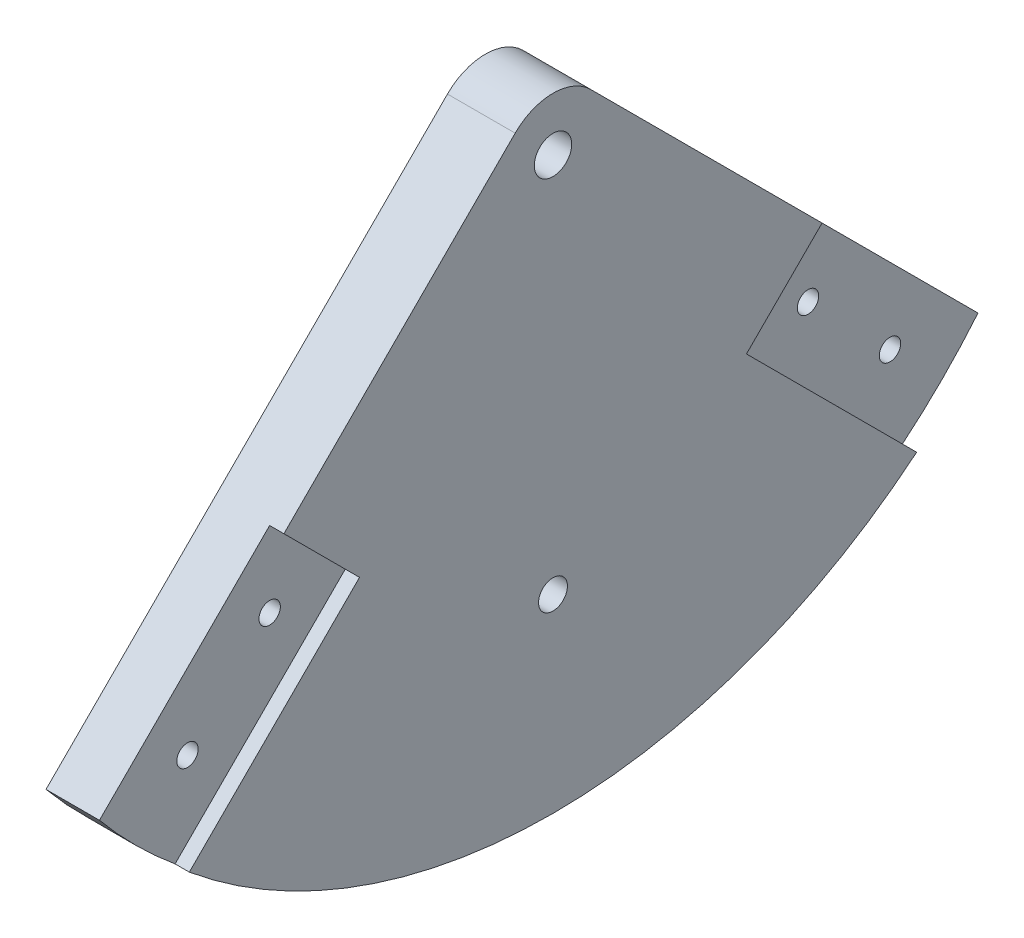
ISO-10303-21;
HEADER;
FILE_DESCRIPTION(('STEP AP214'),'2;1');
FILE_NAME('part.step','',(''),(''),'','','');
FILE_SCHEMA(('AUTOMOTIVE_DESIGN { 1 0 10303 214 1 1 1 1 }'));
ENDSEC;
DATA;
#1=APPLICATION_CONTEXT('core data for automotive mechanical design processes');
#2=APPLICATION_PROTOCOL_DEFINITION('international standard','automotive_design',2000,#1);
#3=PRODUCT_CONTEXT('',#1,'mechanical');
#4=PRODUCT('Part','Part','',(#3));
#5=PRODUCT_RELATED_PRODUCT_CATEGORY('part','',(#4));
#6=PRODUCT_DEFINITION_FORMATION('','',#4);
#7=PRODUCT_DEFINITION_CONTEXT('part definition',#1,'design');
#8=PRODUCT_DEFINITION('design','',#6,#7);
#9=PRODUCT_DEFINITION_SHAPE('','',#8);
#10=(LENGTH_UNIT() NAMED_UNIT(*) SI_UNIT(.MILLI.,.METRE.));
#11=(NAMED_UNIT(*) PLANE_ANGLE_UNIT() SI_UNIT($,.RADIAN.));
#12=(NAMED_UNIT(*) SI_UNIT($,.STERADIAN.) SOLID_ANGLE_UNIT());
#13=UNCERTAINTY_MEASURE_WITH_UNIT(LENGTH_MEASURE(1.E-05),#10,'distance_accuracy_value','');
#14=(GEOMETRIC_REPRESENTATION_CONTEXT(3) GLOBAL_UNCERTAINTY_ASSIGNED_CONTEXT((#13)) GLOBAL_UNIT_ASSIGNED_CONTEXT((#10,
#11,#12)) REPRESENTATION_CONTEXT('',''));
#15=CARTESIAN_POINT('',(0.,0.,0.));
#16=DIRECTION('',(0.,0.,1.));
#17=DIRECTION('',(1.,0.,0.));
#18=AXIS2_PLACEMENT_3D('',#15,#16,#17);
#19=CARTESIAN_POINT('',(-19.,-75.4954988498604,-75.5500035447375));
#20=DIRECTION('',(1.,0.,0.));
#21=DIRECTION('',(0.,0.,-1.));
#22=AXIS2_PLACEMENT_3D('',#19,#20,#21);
#23=CYLINDRICAL_SURFACE('',#22,2.99999999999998);
#24=CARTESIAN_POINT('',(-19.,-75.4954988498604,-75.5500035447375));
#25=DIRECTION('',(1.,0.,0.));
#26=DIRECTION('',(0.,0.,-1.));
#27=AXIS2_PLACEMENT_3D('',#24,#25,#26);
#28=CIRCLE('',#27,2.99999999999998);
#29=CARTESIAN_POINT('',(-19.,-75.4954988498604,-78.5500035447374));
#30=VERTEX_POINT('',#29);
#31=EDGE_CURVE('E174',#30,#30,#28,.T.);
#32=ORIENTED_EDGE('',*,*,#31,.F.);
#33=EDGE_LOOP('',(#32));
#34=FACE_BOUND('',#33,.T.);
#35=CARTESIAN_POINT('',(-4.,-75.4954988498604,-75.5500035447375));
#36=DIRECTION('',(1.,0.,0.));
#37=DIRECTION('',(0.,0.,-1.));
#38=AXIS2_PLACEMENT_3D('',#35,#36,#37);
#39=CIRCLE('',#38,2.99999999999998);
#40=CARTESIAN_POINT('',(-4.,-75.4954988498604,-78.5500035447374));
#41=VERTEX_POINT('',#40);
#42=EDGE_CURVE('E225',#41,#41,#39,.F.);
#43=ORIENTED_EDGE('',*,*,#42,.F.);
#44=EDGE_LOOP('',(#43));
#45=FACE_BOUND('',#44,.T.);
#46=ADVANCED_FACE('F32',(#34,#45),#23,.F.);
#47=CARTESIAN_POINT('',(-19.,-98.5517278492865,-98.5503947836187));
#48=DIRECTION('',(1.,0.,0.));
#49=DIRECTION('',(0.,0.,-1.));
#50=AXIS2_PLACEMENT_3D('',#47,#48,#49);
#51=CYLINDRICAL_SURFACE('',#50,3.00000000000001);
#52=CARTESIAN_POINT('',(-19.,-98.5517278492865,-98.5503947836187));
#53=DIRECTION('',(1.,0.,0.));
#54=DIRECTION('',(0.,0.,-1.));
#55=AXIS2_PLACEMENT_3D('',#52,#53,#54);
#56=CIRCLE('',#55,3.00000000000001);
#57=CARTESIAN_POINT('',(-19.,-98.5517278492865,-101.550394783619));
#58=VERTEX_POINT('',#57);
#59=EDGE_CURVE('E153',#58,#58,#56,.T.);
#60=ORIENTED_EDGE('',*,*,#59,.F.);
#61=EDGE_LOOP('',(#60));
#62=FACE_BOUND('',#61,.T.);
#63=CARTESIAN_POINT('',(-4.,-98.5517278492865,-98.5503947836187));
#64=DIRECTION('',(1.,0.,0.));
#65=DIRECTION('',(0.,0.,-1.));
#66=AXIS2_PLACEMENT_3D('',#63,#64,#65);
#67=CIRCLE('',#66,3.00000000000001);
#68=CARTESIAN_POINT('',(-4.,-98.5517278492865,-101.550394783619));
#69=VERTEX_POINT('',#68);
#70=EDGE_CURVE('E36',#69,#69,#67,.F.);
#71=ORIENTED_EDGE('',*,*,#70,.F.);
#72=EDGE_LOOP('',(#71));
#73=FACE_BOUND('',#72,.T.);
#74=ADVANCED_FACE('F262',(#62,#73),#51,.F.);
#75=CARTESIAN_POINT('',(-19.,-75.4954988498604,75.4969964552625));
#76=DIRECTION('',(1.,0.,0.));
#77=DIRECTION('',(0.,0.,-1.));
#78=AXIS2_PLACEMENT_3D('',#75,#76,#77);
#79=CYLINDRICAL_SURFACE('',#78,2.99999999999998);
#80=CARTESIAN_POINT('',(-19.,-75.4954988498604,75.4969964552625));
#81=DIRECTION('',(1.,0.,0.));
#82=DIRECTION('',(0.,0.,-1.));
#83=AXIS2_PLACEMENT_3D('',#80,#81,#82);
#84=CIRCLE('',#83,2.99999999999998);
#85=CARTESIAN_POINT('',(-19.,-75.4954988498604,72.4969964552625));
#86=VERTEX_POINT('',#85);
#87=EDGE_CURVE('E177',#86,#86,#84,.T.);
#88=ORIENTED_EDGE('',*,*,#87,.F.);
#89=EDGE_LOOP('',(#88));
#90=FACE_BOUND('',#89,.T.);
#91=CARTESIAN_POINT('',(-4.,-75.4954988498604,75.4969964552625));
#92=DIRECTION('',(1.,0.,0.));
#93=DIRECTION('',(0.,0.,-1.));
#94=AXIS2_PLACEMENT_3D('',#91,#92,#93);
#95=CIRCLE('',#94,2.99999999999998);
#96=CARTESIAN_POINT('',(-4.,-75.4954988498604,72.4969964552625));
#97=VERTEX_POINT('',#96);
#98=EDGE_CURVE('E148',#97,#97,#95,.F.);
#99=ORIENTED_EDGE('',*,*,#98,.F.);
#100=EDGE_LOOP('',(#99));
#101=FACE_BOUND('',#100,.T.);
#102=ADVANCED_FACE('F268',(#90,#101),#79,.F.);
#103=CARTESIAN_POINT('',(-19.,-98.5517278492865,98.5530609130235));
#104=DIRECTION('',(1.,0.,0.));
#105=DIRECTION('',(0.,0.,-1.));
#106=AXIS2_PLACEMENT_3D('',#103,#104,#105);
#107=CYLINDRICAL_SURFACE('',#106,3.00000000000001);
#108=CARTESIAN_POINT('',(-19.,-98.5517278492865,98.5530609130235));
#109=DIRECTION('',(1.,0.,0.));
#110=DIRECTION('',(0.,0.,-1.));
#111=AXIS2_PLACEMENT_3D('',#108,#109,#110);
#112=CIRCLE('',#111,3.00000000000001);
#113=CARTESIAN_POINT('',(-19.,-98.5517278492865,95.5530609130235));
#114=VERTEX_POINT('',#113);
#115=EDGE_CURVE('E171',#114,#114,#112,.T.);
#116=ORIENTED_EDGE('',*,*,#115,.F.);
#117=EDGE_LOOP('',(#116));
#118=FACE_BOUND('',#117,.T.);
#119=CARTESIAN_POINT('',(-4.,-98.5517278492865,98.5530609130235));
#120=DIRECTION('',(1.,0.,0.));
#121=DIRECTION('',(0.,0.,-1.));
#122=AXIS2_PLACEMENT_3D('',#119,#120,#121);
#123=CIRCLE('',#122,3.00000000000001);
#124=CARTESIAN_POINT('',(-4.,-98.5517278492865,95.5530609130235));
#125=VERTEX_POINT('',#124);
#126=EDGE_CURVE('E146',#125,#125,#123,.F.);
#127=ORIENTED_EDGE('',*,*,#126,.F.);
#128=EDGE_LOOP('',(#127));
#129=FACE_BOUND('',#128,.T.);
#130=ADVANCED_FACE('F275',(#118,#129),#107,.F.);
#131=CARTESIAN_POINT('',(-19.,-0.00135693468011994,0.0011233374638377));
#132=DIRECTION('',(1.,0.,0.));
#133=DIRECTION('',(0.,0.,-1.));
#134=AXIS2_PLACEMENT_3D('',#131,#132,#133);
#135=CYLINDRICAL_SURFACE('',#134,15.0017864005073);
#136=CARTESIAN_POINT('',(0.,-0.00135693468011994,0.0011233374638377));
#137=DIRECTION('',(1.,0.,0.));
#138=DIRECTION('',(0.,0.,1.));
#139=AXIS2_PLACEMENT_3D('',#136,#137,#138);
#140=CIRCLE('',#139,15.0017864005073);
#141=CARTESIAN_POINT('',(0.,10.6066361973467,-10.6066133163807));
#142=VERTEX_POINT('',#141);
#143=CARTESIAN_POINT('',(0.,10.6065368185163,10.6089593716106));
#144=VERTEX_POINT('',#143);
#145=EDGE_CURVE('E190',#142,#144,#140,.T.);
#146=ORIENTED_EDGE('',*,*,#145,.F.);
#147=DIRECTION('',(1.,0.,0.));
#148=VECTOR('',#147,1.);
#149=CARTESIAN_POINT('',(-19.,10.6066361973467,-10.6066133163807));
#150=LINE('',#149,#148);
#151=CARTESIAN_POINT('',(-19.,10.6066361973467,-10.6066133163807));
#152=VERTEX_POINT('',#151);
#153=EDGE_CURVE('E11',#152,#142,#150,.T.);
#154=ORIENTED_EDGE('',*,*,#153,.F.);
#155=CARTESIAN_POINT('',(-19.,-0.00135693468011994,0.0011233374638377));
#156=DIRECTION('',(1.,0.,0.));
#157=DIRECTION('',(0.,0.,1.));
#158=AXIS2_PLACEMENT_3D('',#155,#156,#157);
#159=CIRCLE('',#158,15.0017864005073);
#160=CARTESIAN_POINT('',(-19.,10.6065368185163,10.6089593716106));
#161=VERTEX_POINT('',#160);
#162=EDGE_CURVE('E193',#152,#161,#159,.T.);
#163=ORIENTED_EDGE('',*,*,#162,.T.);
#164=DIRECTION('',(1.,0.,0.));
#165=VECTOR('',#164,1.);
#166=CARTESIAN_POINT('',(-19.,10.6065368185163,10.6089593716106));
#167=LINE('',#166,#165);
#168=EDGE_CURVE('E141',#161,#144,#167,.T.);
#169=ORIENTED_EDGE('',*,*,#168,.T.);
#170=EDGE_LOOP('',(#146,#154,#163,#169));
#171=FACE_BOUND('',#170,.T.);
#172=ADVANCED_FACE('F34',(#171),#135,.T.);
#173=CARTESIAN_POINT('',(-19.,-102.032204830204,-123.24817777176));
#174=DIRECTION('',(0.,0.70711532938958,-0.707098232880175));
#175=DIRECTION('',(0.,0.707098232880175,0.70711532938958));
#176=AXIS2_PLACEMENT_3D('',#173,#174,#175);
#177=PLANE('',#176);
#178=DIRECTION('',(1.,0.,0.));
#179=VECTOR('',#178,1.);
#180=CARTESIAN_POINT('',(-4.,-54.2822909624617,-75.4971093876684));
#181=LINE('',#180,#179);
#182=CARTESIAN_POINT('',(-4.,-54.2822909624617,-75.4971093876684));
#183=VERTEX_POINT('',#182);
#184=CARTESIAN_POINT('',(0.,-54.2822909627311,-75.4971093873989));
#185=VERTEX_POINT('',#184);
#186=EDGE_CURVE('E49',#183,#185,#181,.T.);
#187=ORIENTED_EDGE('',*,*,#186,.F.);
#188=DIRECTION('',(0.,0.707098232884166,0.707115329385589));
#189=VECTOR('',#188,1.);
#190=CARTESIAN_POINT('',(-4.,-102.032204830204,-123.248177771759));
#191=LINE('',#190,#189);
#192=CARTESIAN_POINT('',(-4.,-102.032204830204,-123.248177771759));
#193=VERTEX_POINT('',#192);
#194=EDGE_CURVE('E119',#193,#183,#191,.T.);
#195=ORIENTED_EDGE('',*,*,#194,.F.);
#196=DIRECTION('',(1.,0.,0.));
#197=VECTOR('',#196,1.);
#198=CARTESIAN_POINT('',(-19.,-102.032204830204,-123.24817777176));
#199=LINE('',#198,#197);
#200=CARTESIAN_POINT('',(-19.,-102.032204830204,-123.24817777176));
#201=VERTEX_POINT('',#200);
#202=EDGE_CURVE('E41',#201,#193,#199,.T.);
#203=ORIENTED_EDGE('',*,*,#202,.F.);
#204=DIRECTION('',(0.,0.707098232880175,0.70711532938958));
#205=VECTOR('',#204,1.);
#206=CARTESIAN_POINT('',(-19.,-102.032204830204,-123.24817777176));
#207=LINE('',#206,#205);
#208=EDGE_CURVE('E145',#201,#152,#207,.T.);
#209=ORIENTED_EDGE('',*,*,#208,.T.);
#210=ORIENTED_EDGE('',*,*,#153,.T.);
#211=DIRECTION('',(0.,0.707098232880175,0.70711532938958));
#212=VECTOR('',#211,1.);
#213=CARTESIAN_POINT('',(0.,-102.032204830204,-123.24817777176));
#214=LINE('',#213,#212);
#215=EDGE_CURVE('E197',#185,#142,#214,.T.);
#216=ORIENTED_EDGE('',*,*,#215,.F.);
#217=EDGE_LOOP('',(#187,#195,#203,#209,#210,#216));
#218=FACE_BOUND('',#217,.T.);
#219=ADVANCED_FACE('F128',(#218),#177,.T.);
#220=CARTESIAN_POINT('',(-19.,-0.00135693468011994,0.0011233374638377));
#221=DIRECTION('',(1.,0.,0.));
#222=DIRECTION('',(0.,0.,-1.));
#223=AXIS2_PLACEMENT_3D('',#220,#221,#222);
#224=CYLINDRICAL_SURFACE('',#223,160.002137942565);
#225=DIRECTION('',(1.,0.,0.));
#226=VECTOR('',#225,1.);
#227=CARTESIAN_POINT('',(-4.,-123.247012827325,-102.034127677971));
#228=LINE('',#227,#226);
#229=CARTESIAN_POINT('',(-4.,-123.247012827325,-102.034127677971));
#230=VERTEX_POINT('',#229);
#231=CARTESIAN_POINT('',(0.,-123.247012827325,-102.034127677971));
#232=VERTEX_POINT('',#231);
#233=EDGE_CURVE('E238',#230,#232,#228,.T.);
#234=ORIENTED_EDGE('',*,*,#233,.T.);
#235=CARTESIAN_POINT('',(0.,-0.00135693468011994,0.0011233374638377));
#236=DIRECTION('',(1.,0.,0.));
#237=DIRECTION('',(0.,0.,-1.));
#238=AXIS2_PLACEMENT_3D('',#235,#236,#237);
#239=CIRCLE('',#238,160.002137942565);
#240=CARTESIAN_POINT('',(0.,-123.249567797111,102.03328819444));
#241=VERTEX_POINT('',#240);
#242=EDGE_CURVE('E206',#241,#232,#239,.T.);
#243=ORIENTED_EDGE('',*,*,#242,.F.);
#244=DIRECTION('',(1.,0.,0.));
#245=VECTOR('',#244,1.);
#246=CARTESIAN_POINT('',(-4.,-123.249567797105,102.033288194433));
#247=LINE('',#246,#245);
#248=CARTESIAN_POINT('',(-4.,-123.249567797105,102.033288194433));
#249=VERTEX_POINT('',#248);
#250=EDGE_CURVE('E57',#249,#241,#247,.T.);
#251=ORIENTED_EDGE('',*,*,#250,.F.);
#252=CARTESIAN_POINT('',(-4.,-0.00135693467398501,0.00112333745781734));
#253=DIRECTION('',(1.,0.,0.));
#254=DIRECTION('',(0.,0.,-1.));
#255=AXIS2_PLACEMENT_3D('',#252,#253,#254);
#256=CIRCLE('',#255,160.002137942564);
#257=CARTESIAN_POINT('',(-4.,-102.033359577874,123.249468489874));
#258=VERTEX_POINT('',#257);
#259=EDGE_CURVE('E221',#258,#249,#256,.T.);
#260=ORIENTED_EDGE('',*,*,#259,.F.);
#261=DIRECTION('',(1.,0.,0.));
#262=VECTOR('',#261,1.);
#263=CARTESIAN_POINT('',(-19.,-102.033359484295,123.249468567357));
#264=LINE('',#263,#262);
#265=CARTESIAN_POINT('',(-19.,-102.033359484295,123.249468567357));
#266=VERTEX_POINT('',#265);
#267=EDGE_CURVE('E138',#266,#258,#264,.T.);
#268=ORIENTED_EDGE('',*,*,#267,.F.);
#269=CARTESIAN_POINT('',(-19.,-0.00135693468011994,0.0011233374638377));
#270=DIRECTION('',(1.,0.,0.));
#271=DIRECTION('',(0.,0.,-1.));
#272=AXIS2_PLACEMENT_3D('',#269,#270,#271);
#273=CIRCLE('',#272,160.002137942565);
#274=EDGE_CURVE('E136',#266,#201,#273,.T.);
#275=ORIENTED_EDGE('',*,*,#274,.T.);
#276=ORIENTED_EDGE('',*,*,#202,.T.);
#277=CARTESIAN_POINT('',(-4.,-0.00135693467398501,0.00112333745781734));
#278=DIRECTION('',(1.,0.,0.));
#279=DIRECTION('',(0.,0.,-1.));
#280=AXIS2_PLACEMENT_3D('',#277,#278,#279);
#281=CIRCLE('',#280,160.002137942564);
#282=EDGE_CURVE('E114',#230,#193,#281,.T.);
#283=ORIENTED_EDGE('',*,*,#282,.F.);
#284=EDGE_LOOP('',(#234,#243,#251,#260,#268,#275,#276,#283));
#285=FACE_BOUND('',#284,.T.);
#286=ADVANCED_FACE('F134',(#285),#224,.T.);
#287=CARTESIAN_POINT('',(-19.,10.6065368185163,10.6089593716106));
#288=DIRECTION('',(0.,0.707108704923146,0.707104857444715));
#289=DIRECTION('',(0.,-0.707104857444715,0.707108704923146));
#290=AXIS2_PLACEMENT_3D('',#287,#288,#289);
#291=PLANE('',#290);
#292=DIRECTION('',(1.,0.,0.));
#293=VECTOR('',#292,1.);
#294=CARTESIAN_POINT('',(-4.,-54.2817962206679,75.4976454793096));
#295=LINE('',#294,#293);
#296=CARTESIAN_POINT('',(-4.,-54.2817962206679,75.4976454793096));
#297=VERTEX_POINT('',#296);
#298=CARTESIAN_POINT('',(0.,-54.2817962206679,75.4976454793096));
#299=VERTEX_POINT('',#298);
#300=EDGE_CURVE('E149',#297,#299,#295,.T.);
#301=ORIENTED_EDGE('',*,*,#300,.T.);
#302=DIRECTION('',(0.,-0.707104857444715,0.707108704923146));
#303=VECTOR('',#302,1.);
#304=CARTESIAN_POINT('',(0.,10.6065368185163,10.6089593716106));
#305=LINE('',#304,#303);
#306=EDGE_CURVE('E204',#144,#299,#305,.T.);
#307=ORIENTED_EDGE('',*,*,#306,.F.);
#308=ORIENTED_EDGE('',*,*,#168,.F.);
#309=DIRECTION('',(0.,-0.707104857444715,0.707108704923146));
#310=VECTOR('',#309,1.);
#311=CARTESIAN_POINT('',(-19.,10.6065368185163,10.6089593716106));
#312=LINE('',#311,#310);
#313=EDGE_CURVE('E196',#161,#266,#312,.T.);
#314=ORIENTED_EDGE('',*,*,#313,.T.);
#315=ORIENTED_EDGE('',*,*,#267,.T.);
#316=DIRECTION('',(0.,-0.707104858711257,0.707108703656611));
#317=VECTOR('',#316,1.);
#318=CARTESIAN_POINT('',(-4.,-54.2817962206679,75.4976454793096));
#319=LINE('',#318,#317);
#320=EDGE_CURVE('E167',#297,#258,#319,.T.);
#321=ORIENTED_EDGE('',*,*,#320,.F.);
#322=EDGE_LOOP('',(#301,#307,#308,#314,#315,#321));
#323=FACE_BOUND('',#322,.T.);
#324=ADVANCED_FACE('F216',(#323),#291,.T.);
#325=CARTESIAN_POINT('',(-19.,-0.00135693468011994,0.0011233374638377));
#326=DIRECTION('',(-1.,0.,0.));
#327=DIRECTION('',(0.,0.,1.));
#328=AXIS2_PLACEMENT_3D('',#325,#326,#327);
#329=PLANE('',#328);
#330=ORIENTED_EDGE('',*,*,#59,.T.);
#331=EDGE_LOOP('',(#330));
#332=FACE_BOUND('',#331,.T.);
#333=ORIENTED_EDGE('',*,*,#115,.T.);
#334=EDGE_LOOP('',(#333));
#335=FACE_BOUND('',#334,.T.);
#336=ORIENTED_EDGE('',*,*,#31,.T.);
#337=EDGE_LOOP('',(#336));
#338=FACE_BOUND('',#337,.T.);
#339=ORIENTED_EDGE('',*,*,#87,.T.);
#340=EDGE_LOOP('',(#339));
#341=FACE_BOUND('',#340,.T.);
#342=CARTESIAN_POINT('',(-19.,0.,0.));
#343=DIRECTION('',(1.,0.,0.));
#344=DIRECTION('',(0.,0.,-1.));
#345=AXIS2_PLACEMENT_3D('',#342,#343,#344);
#346=CIRCLE('',#345,5.25000000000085);
#347=CARTESIAN_POINT('',(-19.,0.,-5.25000000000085));
#348=VERTEX_POINT('',#347);
#349=EDGE_CURVE('E181',#348,#348,#346,.T.);
#350=ORIENTED_EDGE('',*,*,#349,.T.);
#351=EDGE_LOOP('',(#350));
#352=FACE_BOUND('',#351,.T.);
#353=CARTESIAN_POINT('',(-19.,-106.767916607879,0.));
#354=DIRECTION('',(1.,0.,0.));
#355=DIRECTION('',(0.,0.,-1.));
#356=AXIS2_PLACEMENT_3D('',#353,#354,#355);
#357=CIRCLE('',#356,4.04999999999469);
#358=CARTESIAN_POINT('',(-19.,-106.767916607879,-4.04999999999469));
#359=VERTEX_POINT('',#358);
#360=EDGE_CURVE('E187',#359,#359,#357,.T.);
#361=ORIENTED_EDGE('',*,*,#360,.T.);
#362=EDGE_LOOP('',(#361));
#363=FACE_BOUND('',#362,.T.);
#364=ORIENTED_EDGE('',*,*,#162,.F.);
#365=ORIENTED_EDGE('',*,*,#208,.F.);
#366=ORIENTED_EDGE('',*,*,#274,.F.);
#367=ORIENTED_EDGE('',*,*,#313,.F.);
#368=EDGE_LOOP('',(#364,#365,#366,#367));
#369=FACE_BOUND('',#368,.T.);
#370=ADVANCED_FACE('F248',(#332,#335,#338,#341,#352,#363,#369),#329,.T.);
#371=CARTESIAN_POINT('',(0.,-0.00135693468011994,0.0011233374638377));
#372=DIRECTION('',(-1.,0.,0.));
#373=DIRECTION('',(0.,0.,1.));
#374=AXIS2_PLACEMENT_3D('',#371,#372,#373);
#375=PLANE('',#374);
#376=CARTESIAN_POINT('',(0.,0.,0.));
#377=DIRECTION('',(1.,0.,0.));
#378=DIRECTION('',(0.,0.,-1.));
#379=AXIS2_PLACEMENT_3D('',#376,#377,#378);
#380=CIRCLE('',#379,5.25000000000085);
#381=CARTESIAN_POINT('',(0.,0.,-5.25000000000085));
#382=VERTEX_POINT('',#381);
#383=EDGE_CURVE('E180',#382,#382,#380,.T.);
#384=ORIENTED_EDGE('',*,*,#383,.F.);
#385=EDGE_LOOP('',(#384));
#386=FACE_BOUND('',#385,.T.);
#387=CARTESIAN_POINT('',(0.,-106.767916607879,0.));
#388=DIRECTION('',(1.,0.,0.));
#389=DIRECTION('',(0.,0.,-1.));
#390=AXIS2_PLACEMENT_3D('',#387,#388,#389);
#391=CIRCLE('',#390,4.04999999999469);
#392=CARTESIAN_POINT('',(0.,-106.767916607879,-4.04999999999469));
#393=VERTEX_POINT('',#392);
#394=EDGE_CURVE('E184',#393,#393,#391,.T.);
#395=ORIENTED_EDGE('',*,*,#394,.F.);
#396=EDGE_LOOP('',(#395));
#397=FACE_BOUND('',#396,.T.);
#398=ORIENTED_EDGE('',*,*,#242,.T.);
#399=DIRECTION('',(0.,-0.707104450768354,-0.707109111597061));
#400=VECTOR('',#399,1.);
#401=CARTESIAN_POINT('',(0.,-123.247012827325,-102.034127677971));
#402=LINE('',#401,#400);
#403=CARTESIAN_POINT('',(0.,-75.4963001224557,-54.2831002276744));
#404=VERTEX_POINT('',#403);
#405=EDGE_CURVE('E125',#404,#232,#402,.T.);
#406=ORIENTED_EDGE('',*,*,#405,.F.);
#407=DIRECTION('',(0.,-0.707106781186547,0.707106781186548));
#408=VECTOR('',#407,1.);
#409=CARTESIAN_POINT('',(0.,-75.4963001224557,-54.2831002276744));
#410=LINE('',#409,#408);
#411=EDGE_CURVE('E212',#185,#404,#410,.T.);
#412=ORIENTED_EDGE('',*,*,#411,.F.);
#413=ORIENTED_EDGE('',*,*,#215,.T.);
#414=ORIENTED_EDGE('',*,*,#145,.T.);
#415=ORIENTED_EDGE('',*,*,#306,.T.);
#416=DIRECTION('',(0.,0.70710656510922,0.707106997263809));
#417=VECTOR('',#416,1.);
#418=CARTESIAN_POINT('',(0.,-54.2817962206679,75.4976454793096));
#419=LINE('',#418,#417);
#420=CARTESIAN_POINT('',(0.,-75.4963178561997,54.2831108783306));
#421=VERTEX_POINT('',#420);
#422=EDGE_CURVE('E164',#421,#299,#419,.T.);
#423=ORIENTED_EDGE('',*,*,#422,.F.);
#424=DIRECTION('',(0.,0.707129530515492,-0.707084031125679));
#425=VECTOR('',#424,1.);
#426=CARTESIAN_POINT('',(0.,-75.4963178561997,54.2831108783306));
#427=LINE('',#426,#425);
#428=EDGE_CURVE('E218',#241,#421,#427,.T.);
#429=ORIENTED_EDGE('',*,*,#428,.F.);
#430=EDGE_LOOP('',(#398,#406,#412,#413,#414,#415,#423,#429));
#431=FACE_BOUND('',#430,.T.);
#432=ADVANCED_FACE('F209',(#386,#397,#431),#375,.F.);
#433=CARTESIAN_POINT('',(-19.,-106.767916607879,0.));
#434=DIRECTION('',(1.,0.,0.));
#435=DIRECTION('',(0.,0.,-1.));
#436=AXIS2_PLACEMENT_3D('',#433,#434,#435);
#437=CYLINDRICAL_SURFACE('',#436,4.04999999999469);
#438=ORIENTED_EDGE('',*,*,#360,.F.);
#439=EDGE_LOOP('',(#438));
#440=FACE_BOUND('',#439,.T.);
#441=ORIENTED_EDGE('',*,*,#394,.T.);
#442=EDGE_LOOP('',(#441));
#443=FACE_BOUND('',#442,.T.);
#444=ADVANCED_FACE('F256',(#440,#443),#437,.F.);
#445=CARTESIAN_POINT('',(-19.,0.,0.));
#446=DIRECTION('',(1.,0.,0.));
#447=DIRECTION('',(0.,0.,-1.));
#448=AXIS2_PLACEMENT_3D('',#445,#446,#447);
#449=CYLINDRICAL_SURFACE('',#448,5.25000000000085);
#450=ORIENTED_EDGE('',*,*,#349,.F.);
#451=EDGE_LOOP('',(#450));
#452=FACE_BOUND('',#451,.T.);
#453=ORIENTED_EDGE('',*,*,#383,.T.);
#454=EDGE_LOOP('',(#453));
#455=FACE_BOUND('',#454,.T.);
#456=ADVANCED_FACE('F279',(#452,#455),#449,.F.);
#457=CARTESIAN_POINT('',(-4.,-0.00135693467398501,0.00112333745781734));
#458=DIRECTION('',(1.,0.,0.));
#459=DIRECTION('',(0.,0.,-1.));
#460=AXIS2_PLACEMENT_3D('',#457,#458,#459);
#461=PLANE('',#460);
#462=ORIENTED_EDGE('',*,*,#126,.T.);
#463=EDGE_LOOP('',(#462));
#464=FACE_BOUND('',#463,.T.);
#465=ORIENTED_EDGE('',*,*,#259,.T.);
#466=DIRECTION('',(0.,0.707129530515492,-0.707084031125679));
#467=VECTOR('',#466,1.);
#468=CARTESIAN_POINT('',(-4.,-75.4963178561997,54.2831108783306));
#469=LINE('',#468,#467);
#470=CARTESIAN_POINT('',(-4.,-75.4963178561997,54.2831108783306));
#471=VERTEX_POINT('',#470);
#472=EDGE_CURVE('E223',#249,#471,#469,.T.);
#473=ORIENTED_EDGE('',*,*,#472,.T.);
#474=DIRECTION('',(0.,0.70710656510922,0.707106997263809));
#475=VECTOR('',#474,1.);
#476=CARTESIAN_POINT('',(-4.,-54.2817962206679,75.4976454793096));
#477=LINE('',#476,#475);
#478=EDGE_CURVE('E230',#471,#297,#477,.T.);
#479=ORIENTED_EDGE('',*,*,#478,.T.);
#480=ORIENTED_EDGE('',*,*,#320,.T.);
#481=EDGE_LOOP('',(#465,#473,#479,#480));
#482=FACE_BOUND('',#481,.T.);
#483=ORIENTED_EDGE('',*,*,#98,.T.);
#484=EDGE_LOOP('',(#483));
#485=FACE_BOUND('',#484,.T.);
#486=ADVANCED_FACE('F281',(#464,#482,#485),#461,.T.);
#487=CARTESIAN_POINT('',(-4.,-54.2817962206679,75.4976454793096));
#488=DIRECTION('',(0.,0.707106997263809,-0.70710656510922));
#489=DIRECTION('',(0.,0.70710656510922,0.707106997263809));
#490=AXIS2_PLACEMENT_3D('',#487,#488,#489);
#491=PLANE('',#490);
#492=ORIENTED_EDGE('',*,*,#422,.T.);
#493=ORIENTED_EDGE('',*,*,#300,.F.);
#494=ORIENTED_EDGE('',*,*,#478,.F.);
#495=DIRECTION('',(1.,0.,0.));
#496=VECTOR('',#495,1.);
#497=CARTESIAN_POINT('',(-4.,-75.4963178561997,54.2831108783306));
#498=LINE('',#497,#496);
#499=EDGE_CURVE('E156',#471,#421,#498,.T.);
#500=ORIENTED_EDGE('',*,*,#499,.T.);
#501=EDGE_LOOP('',(#492,#493,#494,#500));
#502=FACE_BOUND('',#501,.T.);
#503=ADVANCED_FACE('F304',(#502),#491,.F.);
#504=CARTESIAN_POINT('',(-4.,-75.4963178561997,54.2831108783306));
#505=DIRECTION('',(0.,-0.707084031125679,-0.707129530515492));
#506=DIRECTION('',(0.,0.707129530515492,-0.707084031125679));
#507=AXIS2_PLACEMENT_3D('',#504,#505,#506);
#508=PLANE('',#507);
#509=ORIENTED_EDGE('',*,*,#428,.T.);
#510=ORIENTED_EDGE('',*,*,#499,.F.);
#511=ORIENTED_EDGE('',*,*,#472,.F.);
#512=ORIENTED_EDGE('',*,*,#250,.T.);
#513=EDGE_LOOP('',(#509,#510,#511,#512));
#514=FACE_BOUND('',#513,.T.);
#515=ADVANCED_FACE('F311',(#514),#508,.F.);
#516=CARTESIAN_POINT('',(-4.,-0.00135693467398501,0.00112333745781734));
#517=DIRECTION('',(1.,0.,0.));
#518=DIRECTION('',(0.,0.,-1.));
#519=AXIS2_PLACEMENT_3D('',#516,#517,#518);
#520=PLANE('',#519);
#521=ORIENTED_EDGE('',*,*,#70,.T.);
#522=EDGE_LOOP('',(#521));
#523=FACE_BOUND('',#522,.T.);
#524=ORIENTED_EDGE('',*,*,#282,.T.);
#525=ORIENTED_EDGE('',*,*,#194,.T.);
#526=DIRECTION('',(0.,-0.707106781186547,0.707106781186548));
#527=VECTOR('',#526,1.);
#528=CARTESIAN_POINT('',(-4.,-75.4963001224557,-54.2831002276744));
#529=LINE('',#528,#527);
#530=CARTESIAN_POINT('',(-4.,-75.4963001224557,-54.2831002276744));
#531=VERTEX_POINT('',#530);
#532=EDGE_CURVE('E132',#183,#531,#529,.T.);
#533=ORIENTED_EDGE('',*,*,#532,.T.);
#534=DIRECTION('',(0.,-0.707104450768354,-0.707109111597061));
#535=VECTOR('',#534,1.);
#536=CARTESIAN_POINT('',(-4.,-123.247012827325,-102.034127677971));
#537=LINE('',#536,#535);
#538=EDGE_CURVE('E121',#531,#230,#537,.T.);
#539=ORIENTED_EDGE('',*,*,#538,.T.);
#540=EDGE_LOOP('',(#524,#525,#533,#539));
#541=FACE_BOUND('',#540,.T.);
#542=ORIENTED_EDGE('',*,*,#42,.T.);
#543=EDGE_LOOP('',(#542));
#544=FACE_BOUND('',#543,.T.);
#545=ADVANCED_FACE('F116',(#523,#541,#544),#520,.T.);
#546=CARTESIAN_POINT('',(-4.,-123.247012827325,-102.034127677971));
#547=DIRECTION('',(0.,-0.707109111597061,0.707104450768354));
#548=DIRECTION('',(0.,-0.707104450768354,-0.707109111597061));
#549=AXIS2_PLACEMENT_3D('',#546,#547,#548);
#550=PLANE('',#549);
#551=ORIENTED_EDGE('',*,*,#405,.T.);
#552=ORIENTED_EDGE('',*,*,#233,.F.);
#553=ORIENTED_EDGE('',*,*,#538,.F.);
#554=DIRECTION('',(1.,0.,0.));
#555=VECTOR('',#554,1.);
#556=CARTESIAN_POINT('',(-4.,-75.4963001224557,-54.2831002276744));
#557=LINE('',#556,#555);
#558=EDGE_CURVE('E236',#531,#404,#557,.T.);
#559=ORIENTED_EDGE('',*,*,#558,.T.);
#560=EDGE_LOOP('',(#551,#552,#553,#559));
#561=FACE_BOUND('',#560,.T.);
#562=ADVANCED_FACE('F244',(#561),#550,.F.);
#563=CARTESIAN_POINT('',(-4.,-75.4963001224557,-54.2831002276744));
#564=DIRECTION('',(0.,0.707106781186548,0.707106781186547));
#565=DIRECTION('',(0.,-0.707106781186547,0.707106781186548));
#566=AXIS2_PLACEMENT_3D('',#563,#564,#565);
#567=PLANE('',#566);
#568=ORIENTED_EDGE('',*,*,#411,.T.);
#569=ORIENTED_EDGE('',*,*,#558,.F.);
#570=ORIENTED_EDGE('',*,*,#532,.F.);
#571=ORIENTED_EDGE('',*,*,#186,.T.);
#572=EDGE_LOOP('',(#568,#569,#570,#571));
#573=FACE_BOUND('',#572,.T.);
#574=ADVANCED_FACE('F331',(#573),#567,.F.);
#575=CLOSED_SHELL('',(#46,#74,#102,#130,#172,#219,#286,#324,#370,#432,#444,#456,#486,#503,#515,
#545,#562,#574));
#576=MANIFOLD_SOLID_BREP('B2',#575);
#577=ADVANCED_BREP_SHAPE_REPRESENTATION('',(#18,#576),#14);
#578=SHAPE_DEFINITION_REPRESENTATION(#9,#577);
ENDSEC;
END-ISO-10303-21;
